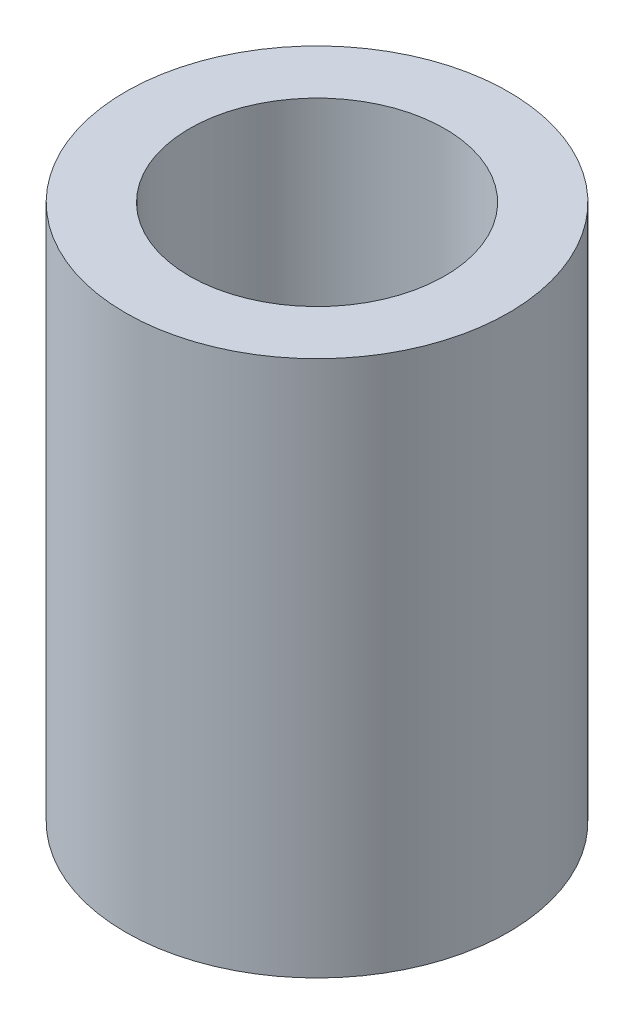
from build123d import *

# Parameters (mm, degrees)
SKETCH_1_R      = 1.5
SKETCH_1_R_2    = 1
EXTRUDE_1_DEPTH = 4.2


with BuildPart() as part:
    # Sketch 1 → Extrude 1 (new body)
    with BuildSketch(Plane(origin=(0, 0, 0), x_dir=(1, 0, 0), z_dir=(0, 1, 0))):
        with Locations(Location((0, 0, 0), (0, 0, 270))):
            Circle(SKETCH_1_R)
        with Locations(Location((0, 0, 0), (0, 0, 270))):
            Circle(SKETCH_1_R_2, mode=Mode.SUBTRACT)
    extrude(amount=EXTRUDE_1_DEPTH)


solid = part.part
